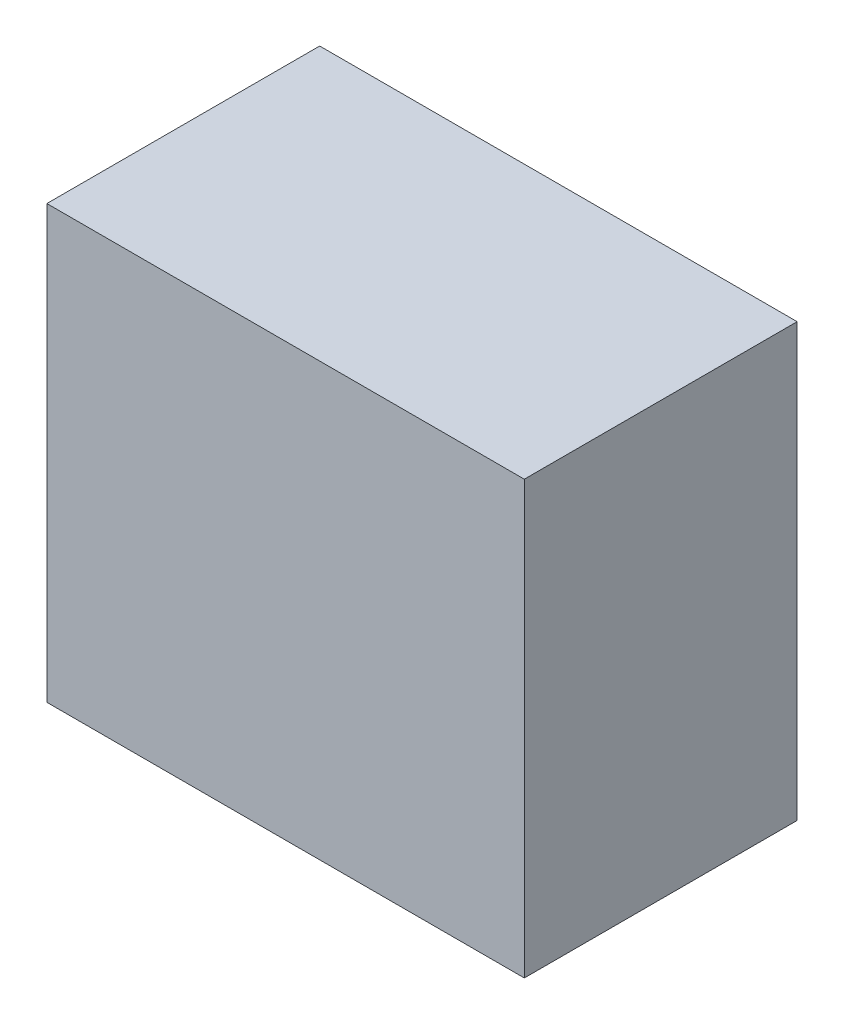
from build123d import *

# Parameters (mm, degrees)
ESQUISSE1_W        = 105
ESQUISSE1_H        = 95
BOSS_EXTRU_1_DEPTH = 60


with BuildPart() as part:
    # Esquisse1 → Boss.-Extru.1 (new body)
    with BuildSketch(Plane.XY):
        with Locations((52.5, 47.5)):
            Rectangle(ESQUISSE1_W, ESQUISSE1_H)
    extrude(amount=BOSS_EXTRU_1_DEPTH)


solid = part.part
